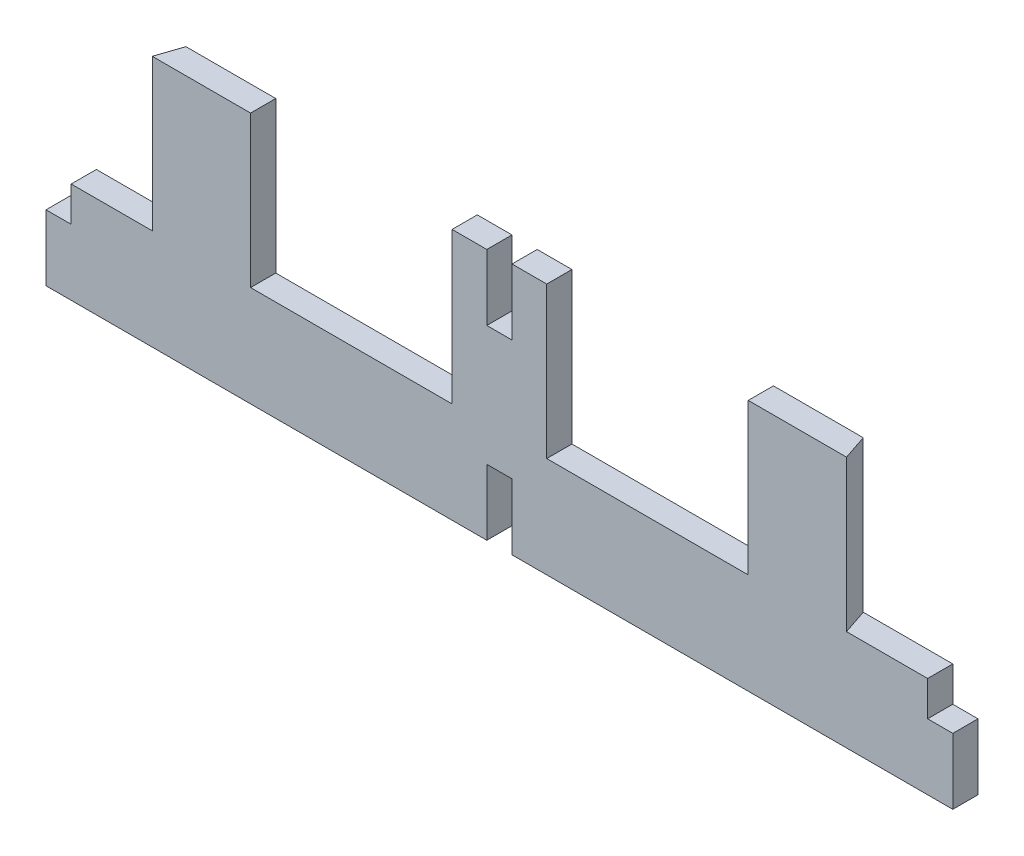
ISO-10303-21;
HEADER;
FILE_DESCRIPTION(('STEP AP214'),'2;1');
FILE_NAME('part.step','',(''),(''),'','','');
FILE_SCHEMA(('AUTOMOTIVE_DESIGN { 1 0 10303 214 1 1 1 1 }'));
ENDSEC;
DATA;
#1=APPLICATION_CONTEXT('core data for automotive mechanical design processes');
#2=APPLICATION_PROTOCOL_DEFINITION('international standard','automotive_design',2000,#1);
#3=PRODUCT_CONTEXT('',#1,'mechanical');
#4=PRODUCT('Part','Part','',(#3));
#5=PRODUCT_RELATED_PRODUCT_CATEGORY('part','',(#4));
#6=PRODUCT_DEFINITION_FORMATION('','',#4);
#7=PRODUCT_DEFINITION_CONTEXT('part definition',#1,'design');
#8=PRODUCT_DEFINITION('design','',#6,#7);
#9=PRODUCT_DEFINITION_SHAPE('','',#8);
#10=(LENGTH_UNIT() NAMED_UNIT(*) SI_UNIT(.MILLI.,.METRE.));
#11=(NAMED_UNIT(*) PLANE_ANGLE_UNIT() SI_UNIT($,.RADIAN.));
#12=(NAMED_UNIT(*) SI_UNIT($,.STERADIAN.) SOLID_ANGLE_UNIT());
#13=UNCERTAINTY_MEASURE_WITH_UNIT(LENGTH_MEASURE(1.E-05),#10,'distance_accuracy_value','');
#14=(GEOMETRIC_REPRESENTATION_CONTEXT(3) GLOBAL_UNCERTAINTY_ASSIGNED_CONTEXT((#13)) GLOBAL_UNIT_ASSIGNED_CONTEXT((#10,
#11,#12)) REPRESENTATION_CONTEXT('',''));
#15=CARTESIAN_POINT('',(0.,0.,0.));
#16=DIRECTION('',(0.,0.,1.));
#17=DIRECTION('',(1.,0.,0.));
#18=AXIS2_PLACEMENT_3D('',#15,#16,#17);
#19=CARTESIAN_POINT('',(-215.9,93.8094552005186,12.7));
#20=DIRECTION('',(1.,0.,0.));
#21=DIRECTION('',(0.,1.,0.));
#22=AXIS2_PLACEMENT_3D('',#19,#20,#21);
#23=PLANE('',#22);
#24=DIRECTION('',(0.,0.,1.));
#25=VECTOR('',#24,1.);
#26=CARTESIAN_POINT('',(-215.9,50.8,12.7));
#27=LINE('',#26,#25);
#28=CARTESIAN_POINT('',(-215.9,50.8,0.));
#29=VERTEX_POINT('',#28);
#30=CARTESIAN_POINT('',(-215.9,50.8,12.7));
#31=VERTEX_POINT('',#30);
#32=EDGE_CURVE('E249',#29,#31,#27,.T.);
#33=ORIENTED_EDGE('',*,*,#32,.F.);
#34=DIRECTION('',(0.,-1.,0.));
#35=VECTOR('',#34,1.);
#36=CARTESIAN_POINT('',(-215.9,93.8094552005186,0.));
#37=LINE('',#36,#35);
#38=CARTESIAN_POINT('',(-215.9,33.1905447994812,0.));
#39=VERTEX_POINT('',#38);
#40=EDGE_CURVE('E296',#29,#39,#37,.T.);
#41=ORIENTED_EDGE('',*,*,#40,.T.);
#42=DIRECTION('',(0.,0.,-1.));
#43=VECTOR('',#42,1.);
#44=CARTESIAN_POINT('',(-215.9,33.1905447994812,12.7));
#45=LINE('',#44,#43);
#46=CARTESIAN_POINT('',(-215.9,33.1905447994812,12.7));
#47=VERTEX_POINT('',#46);
#48=EDGE_CURVE('E38',#47,#39,#45,.T.);
#49=ORIENTED_EDGE('',*,*,#48,.F.);
#50=DIRECTION('',(0.,-1.,0.));
#51=VECTOR('',#50,1.);
#52=CARTESIAN_POINT('',(-215.9,93.8094552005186,12.7));
#53=LINE('',#52,#51);
#54=EDGE_CURVE('E305',#31,#47,#53,.T.);
#55=ORIENTED_EDGE('',*,*,#54,.F.);
#56=EDGE_LOOP('',(#33,#41,#49,#55));
#57=FACE_BOUND('',#56,.T.);
#58=ADVANCED_FACE('F31',(#57),#23,.F.);
#59=CARTESIAN_POINT('',(-228.6,127.,12.7));
#60=DIRECTION('',(0.,-1.,0.));
#61=DIRECTION('',(1.,0.,0.));
#62=AXIS2_PLACEMENT_3D('',#59,#60,#61);
#63=PLANE('',#62);
#64=DIRECTION('',(-1.,0.,0.));
#65=VECTOR('',#64,1.);
#66=CARTESIAN_POINT('',(-228.6,127.,0.));
#67=LINE('',#66,#65);
#68=CARTESIAN_POINT('',(-125.459231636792,127.,0.));
#69=VERTEX_POINT('',#68);
#70=CARTESIAN_POINT('',(-170.743201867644,127.,0.));
#71=VERTEX_POINT('',#70);
#72=EDGE_CURVE('E372',#69,#71,#67,.T.);
#73=ORIENTED_EDGE('',*,*,#72,.T.);
#74=DIRECTION('',(0.318463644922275,0.,-0.947935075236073));
#75=VECTOR('',#74,1.);
#76=CARTESIAN_POINT('',(-175.009831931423,127.,12.7));
#77=LINE('',#76,#75);
#78=CARTESIAN_POINT('',(-175.009831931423,127.,12.7));
#79=VERTEX_POINT('',#78);
#80=EDGE_CURVE('E238',#79,#71,#77,.T.);
#81=ORIENTED_EDGE('',*,*,#80,.F.);
#82=DIRECTION('',(-1.,0.,0.));
#83=VECTOR('',#82,1.);
#84=CARTESIAN_POINT('',(-228.6,127.,12.7));
#85=LINE('',#84,#83);
#86=CARTESIAN_POINT('',(-125.459231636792,127.,12.7));
#87=VERTEX_POINT('',#86);
#88=EDGE_CURVE('E336',#87,#79,#85,.T.);
#89=ORIENTED_EDGE('',*,*,#88,.F.);
#90=DIRECTION('',(0.,0.,1.));
#91=VECTOR('',#90,1.);
#92=CARTESIAN_POINT('',(-125.459231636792,127.,0.));
#93=LINE('',#92,#91);
#94=EDGE_CURVE('E252',#69,#87,#93,.T.);
#95=ORIENTED_EDGE('',*,*,#94,.F.);
#96=EDGE_LOOP('',(#73,#81,#89,#95));
#97=FACE_BOUND('',#96,.T.);
#98=ADVANCED_FACE('F450',(#97),#63,.F.);
#99=CARTESIAN_POINT('',(6.35,127.,12.7));
#100=DIRECTION('',(0.,-1.,0.));
#101=DIRECTION('',(1.,0.,0.));
#102=AXIS2_PLACEMENT_3D('',#99,#100,#101);
#103=PLANE('',#102);
#104=DIRECTION('',(-1.,0.,0.));
#105=VECTOR('',#104,1.);
#106=CARTESIAN_POINT('',(6.35,127.,12.7));
#107=LINE('',#106,#105);
#108=CARTESIAN_POINT('',(23.8592316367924,127.,12.7));
#109=VERTEX_POINT('',#108);
#110=CARTESIAN_POINT('',(6.35,127.,12.7));
#111=VERTEX_POINT('',#110);
#112=EDGE_CURVE('E327',#109,#111,#107,.T.);
#113=ORIENTED_EDGE('',*,*,#112,.F.);
#114=DIRECTION('',(0.,0.,1.));
#115=VECTOR('',#114,1.);
#116=CARTESIAN_POINT('',(23.8592316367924,127.,0.));
#117=LINE('',#116,#115);
#118=CARTESIAN_POINT('',(23.8592316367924,127.,0.));
#119=VERTEX_POINT('',#118);
#120=EDGE_CURVE('E270',#119,#109,#117,.T.);
#121=ORIENTED_EDGE('',*,*,#120,.F.);
#122=DIRECTION('',(-1.,0.,0.));
#123=VECTOR('',#122,1.);
#124=CARTESIAN_POINT('',(6.35,127.,0.));
#125=LINE('',#124,#123);
#126=CARTESIAN_POINT('',(6.35,127.,0.));
#127=VERTEX_POINT('',#126);
#128=EDGE_CURVE('E363',#119,#127,#125,.T.);
#129=ORIENTED_EDGE('',*,*,#128,.T.);
#130=DIRECTION('',(0.,0.,-1.));
#131=VECTOR('',#130,1.);
#132=CARTESIAN_POINT('',(6.35,127.,12.7));
#133=LINE('',#132,#131);
#134=EDGE_CURVE('E383',#111,#127,#133,.T.);
#135=ORIENTED_EDGE('',*,*,#134,.F.);
#136=EDGE_LOOP('',(#113,#121,#129,#135));
#137=FACE_BOUND('',#136,.T.);
#138=ADVANCED_FACE('F486',(#137),#103,.F.);
#139=CARTESIAN_POINT('',(-215.9,33.1905447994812,12.7));
#140=DIRECTION('',(0.,-1.,0.));
#141=DIRECTION('',(0.,0.,-1.));
#142=AXIS2_PLACEMENT_3D('',#139,#140,#141);
#143=PLANE('',#142);
#144=DIRECTION('',(-1.,0.,0.));
#145=VECTOR('',#144,1.);
#146=CARTESIAN_POINT('',(-215.9,33.1905447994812,0.));
#147=LINE('',#146,#145);
#148=CARTESIAN_POINT('',(-228.6,33.1905447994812,0.));
#149=VERTEX_POINT('',#148);
#150=EDGE_CURVE('E342',#39,#149,#147,.T.);
#151=ORIENTED_EDGE('',*,*,#150,.T.);
#152=DIRECTION('',(0.,0.,-1.));
#153=VECTOR('',#152,1.);
#154=CARTESIAN_POINT('',(-228.6,33.1905447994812,12.7));
#155=LINE('',#154,#153);
#156=CARTESIAN_POINT('',(-228.6,33.1905447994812,12.7));
#157=VERTEX_POINT('',#156);
#158=EDGE_CURVE('E410',#157,#149,#155,.T.);
#159=ORIENTED_EDGE('',*,*,#158,.F.);
#160=DIRECTION('',(-1.,0.,0.));
#161=VECTOR('',#160,1.);
#162=CARTESIAN_POINT('',(-215.9,33.1905447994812,12.7));
#163=LINE('',#162,#161);
#164=EDGE_CURVE('E307',#47,#157,#163,.T.);
#165=ORIENTED_EDGE('',*,*,#164,.F.);
#166=ORIENTED_EDGE('',*,*,#48,.T.);
#167=EDGE_LOOP('',(#151,#159,#165,#166));
#168=FACE_BOUND('',#167,.T.);
#169=ADVANCED_FACE('F417',(#168),#143,.F.);
#170=CARTESIAN_POINT('',(-228.6,0.,12.7));
#171=DIRECTION('',(1.,0.,0.));
#172=DIRECTION('',(0.,0.,-1.));
#173=AXIS2_PLACEMENT_3D('',#170,#171,#172);
#174=PLANE('',#173);
#175=DIRECTION('',(0.,-1.,0.));
#176=VECTOR('',#175,1.);
#177=CARTESIAN_POINT('',(-228.6,0.,0.));
#178=LINE('',#177,#176);
#179=CARTESIAN_POINT('',(-228.6,0.,0.));
#180=VERTEX_POINT('',#179);
#181=EDGE_CURVE('E344',#149,#180,#178,.T.);
#182=ORIENTED_EDGE('',*,*,#181,.T.);
#183=DIRECTION('',(0.,0.,-1.));
#184=VECTOR('',#183,1.);
#185=CARTESIAN_POINT('',(-228.6,0.,12.7));
#186=LINE('',#185,#184);
#187=CARTESIAN_POINT('',(-228.6,0.,12.7));
#188=VERTEX_POINT('',#187);
#189=EDGE_CURVE('E407',#188,#180,#186,.T.);
#190=ORIENTED_EDGE('',*,*,#189,.F.);
#191=DIRECTION('',(0.,-1.,0.));
#192=VECTOR('',#191,1.);
#193=CARTESIAN_POINT('',(-228.6,0.,12.7));
#194=LINE('',#193,#192);
#195=EDGE_CURVE('E310',#157,#188,#194,.T.);
#196=ORIENTED_EDGE('',*,*,#195,.F.);
#197=ORIENTED_EDGE('',*,*,#158,.T.);
#198=EDGE_LOOP('',(#182,#190,#196,#197));
#199=FACE_BOUND('',#198,.T.);
#200=ADVANCED_FACE('F431',(#199),#174,.F.);
#201=CARTESIAN_POINT('',(-6.35,0.,12.7));
#202=DIRECTION('',(0.,1.,0.));
#203=DIRECTION('',(0.,0.,1.));
#204=AXIS2_PLACEMENT_3D('',#201,#202,#203);
#205=PLANE('',#204);
#206=DIRECTION('',(1.,0.,0.));
#207=VECTOR('',#206,1.);
#208=CARTESIAN_POINT('',(-6.35,0.,0.));
#209=LINE('',#208,#207);
#210=CARTESIAN_POINT('',(-6.35,0.,0.));
#211=VERTEX_POINT('',#210);
#212=EDGE_CURVE('E346',#180,#211,#209,.T.);
#213=ORIENTED_EDGE('',*,*,#212,.T.);
#214=DIRECTION('',(0.,0.,-1.));
#215=VECTOR('',#214,1.);
#216=CARTESIAN_POINT('',(-6.35,0.,12.7));
#217=LINE('',#216,#215);
#218=CARTESIAN_POINT('',(-6.35,0.,12.7));
#219=VERTEX_POINT('',#218);
#220=EDGE_CURVE('E404',#219,#211,#217,.T.);
#221=ORIENTED_EDGE('',*,*,#220,.F.);
#222=DIRECTION('',(1.,0.,0.));
#223=VECTOR('',#222,1.);
#224=CARTESIAN_POINT('',(-6.35,0.,12.7));
#225=LINE('',#224,#223);
#226=EDGE_CURVE('E312',#188,#219,#225,.T.);
#227=ORIENTED_EDGE('',*,*,#226,.F.);
#228=ORIENTED_EDGE('',*,*,#189,.T.);
#229=EDGE_LOOP('',(#213,#221,#227,#228));
#230=FACE_BOUND('',#229,.T.);
#231=ADVANCED_FACE('F435',(#230),#205,.F.);
#232=CARTESIAN_POINT('',(-6.35,33.1905447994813,12.7));
#233=DIRECTION('',(-1.,0.,0.));
#234=DIRECTION('',(0.,0.,1.));
#235=AXIS2_PLACEMENT_3D('',#232,#233,#234);
#236=PLANE('',#235);
#237=DIRECTION('',(0.,1.,0.));
#238=VECTOR('',#237,1.);
#239=CARTESIAN_POINT('',(-6.35,33.1905447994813,0.));
#240=LINE('',#239,#238);
#241=CARTESIAN_POINT('',(-6.35,33.1905447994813,0.));
#242=VERTEX_POINT('',#241);
#243=EDGE_CURVE('E348',#211,#242,#240,.T.);
#244=ORIENTED_EDGE('',*,*,#243,.T.);
#245=DIRECTION('',(0.,0.,-1.));
#246=VECTOR('',#245,1.);
#247=CARTESIAN_POINT('',(-6.35,33.1905447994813,12.7));
#248=LINE('',#247,#246);
#249=CARTESIAN_POINT('',(-6.35,33.1905447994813,12.7));
#250=VERTEX_POINT('',#249);
#251=EDGE_CURVE('E401',#250,#242,#248,.T.);
#252=ORIENTED_EDGE('',*,*,#251,.F.);
#253=DIRECTION('',(0.,1.,0.));
#254=VECTOR('',#253,1.);
#255=CARTESIAN_POINT('',(-6.35,33.1905447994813,12.7));
#256=LINE('',#255,#254);
#257=EDGE_CURVE('E314',#219,#250,#256,.T.);
#258=ORIENTED_EDGE('',*,*,#257,.F.);
#259=ORIENTED_EDGE('',*,*,#220,.T.);
#260=EDGE_LOOP('',(#244,#252,#258,#259));
#261=FACE_BOUND('',#260,.T.);
#262=ADVANCED_FACE('F590',(#261),#236,.F.);
#263=CARTESIAN_POINT('',(6.35,33.1905447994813,12.7));
#264=DIRECTION('',(0.,1.,0.));
#265=DIRECTION('',(0.,0.,1.));
#266=AXIS2_PLACEMENT_3D('',#263,#264,#265);
#267=PLANE('',#266);
#268=DIRECTION('',(1.,0.,0.));
#269=VECTOR('',#268,1.);
#270=CARTESIAN_POINT('',(6.35,33.1905447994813,0.));
#271=LINE('',#270,#269);
#272=CARTESIAN_POINT('',(6.35,33.1905447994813,0.));
#273=VERTEX_POINT('',#272);
#274=EDGE_CURVE('E350',#242,#273,#271,.T.);
#275=ORIENTED_EDGE('',*,*,#274,.T.);
#276=DIRECTION('',(0.,0.,-1.));
#277=VECTOR('',#276,1.);
#278=CARTESIAN_POINT('',(6.35,33.1905447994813,12.7));
#279=LINE('',#278,#277);
#280=CARTESIAN_POINT('',(6.35,33.1905447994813,12.7));
#281=VERTEX_POINT('',#280);
#282=EDGE_CURVE('E398',#281,#273,#279,.T.);
#283=ORIENTED_EDGE('',*,*,#282,.F.);
#284=DIRECTION('',(1.,0.,0.));
#285=VECTOR('',#284,1.);
#286=CARTESIAN_POINT('',(6.35,33.1905447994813,12.7));
#287=LINE('',#286,#285);
#288=EDGE_CURVE('E316',#250,#281,#287,.T.);
#289=ORIENTED_EDGE('',*,*,#288,.F.);
#290=ORIENTED_EDGE('',*,*,#251,.T.);
#291=EDGE_LOOP('',(#275,#283,#289,#290));
#292=FACE_BOUND('',#291,.T.);
#293=ADVANCED_FACE('F580',(#292),#267,.F.);
#294=CARTESIAN_POINT('',(6.35,33.1905447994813,12.7));
#295=DIRECTION('',(1.,0.,0.));
#296=DIRECTION('',(0.,0.,-1.));
#297=AXIS2_PLACEMENT_3D('',#294,#295,#296);
#298=PLANE('',#297);
#299=DIRECTION('',(0.,-1.,0.));
#300=VECTOR('',#299,1.);
#301=CARTESIAN_POINT('',(6.35,33.1905447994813,0.));
#302=LINE('',#301,#300);
#303=CARTESIAN_POINT('',(6.35,0.,0.));
#304=VERTEX_POINT('',#303);
#305=EDGE_CURVE('E352',#273,#304,#302,.T.);
#306=ORIENTED_EDGE('',*,*,#305,.T.);
#307=DIRECTION('',(0.,0.,-1.));
#308=VECTOR('',#307,1.);
#309=CARTESIAN_POINT('',(6.35,0.,12.7));
#310=LINE('',#309,#308);
#311=CARTESIAN_POINT('',(6.35,0.,12.7));
#312=VERTEX_POINT('',#311);
#313=EDGE_CURVE('E395',#312,#304,#310,.T.);
#314=ORIENTED_EDGE('',*,*,#313,.F.);
#315=DIRECTION('',(0.,-1.,0.));
#316=VECTOR('',#315,1.);
#317=CARTESIAN_POINT('',(6.35,33.1905447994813,12.7));
#318=LINE('',#317,#316);
#319=EDGE_CURVE('E318',#281,#312,#318,.T.);
#320=ORIENTED_EDGE('',*,*,#319,.F.);
#321=ORIENTED_EDGE('',*,*,#282,.T.);
#322=EDGE_LOOP('',(#306,#314,#320,#321));
#323=FACE_BOUND('',#322,.T.);
#324=ADVANCED_FACE('F570',(#323),#298,.F.);
#325=CARTESIAN_POINT('',(6.35,0.,12.7));
#326=DIRECTION('',(0.,1.,0.));
#327=DIRECTION('',(0.,0.,1.));
#328=AXIS2_PLACEMENT_3D('',#325,#326,#327);
#329=PLANE('',#328);
#330=DIRECTION('',(1.,0.,0.));
#331=VECTOR('',#330,1.);
#332=CARTESIAN_POINT('',(6.35,0.,0.));
#333=LINE('',#332,#331);
#334=CARTESIAN_POINT('',(228.6,0.,0.));
#335=VERTEX_POINT('',#334);
#336=EDGE_CURVE('E354',#304,#335,#333,.T.);
#337=ORIENTED_EDGE('',*,*,#336,.T.);
#338=DIRECTION('',(0.,0.,-1.));
#339=VECTOR('',#338,1.);
#340=CARTESIAN_POINT('',(228.6,0.,12.7));
#341=LINE('',#340,#339);
#342=CARTESIAN_POINT('',(228.6,0.,12.7));
#343=VERTEX_POINT('',#342);
#344=EDGE_CURVE('E392',#343,#335,#341,.T.);
#345=ORIENTED_EDGE('',*,*,#344,.F.);
#346=DIRECTION('',(1.,0.,0.));
#347=VECTOR('',#346,1.);
#348=CARTESIAN_POINT('',(6.35,0.,12.7));
#349=LINE('',#348,#347);
#350=EDGE_CURVE('E320',#312,#343,#349,.T.);
#351=ORIENTED_EDGE('',*,*,#350,.F.);
#352=ORIENTED_EDGE('',*,*,#313,.T.);
#353=EDGE_LOOP('',(#337,#345,#351,#352));
#354=FACE_BOUND('',#353,.T.);
#355=ADVANCED_FACE('F560',(#354),#329,.F.);
#356=CARTESIAN_POINT('',(228.6,0.,12.7));
#357=DIRECTION('',(-1.,0.,0.));
#358=DIRECTION('',(0.,0.,1.));
#359=AXIS2_PLACEMENT_3D('',#356,#357,#358);
#360=PLANE('',#359);
#361=DIRECTION('',(0.,1.,0.));
#362=VECTOR('',#361,1.);
#363=CARTESIAN_POINT('',(228.6,0.,0.));
#364=LINE('',#363,#362);
#365=CARTESIAN_POINT('',(228.6,33.1905447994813,0.));
#366=VERTEX_POINT('',#365);
#367=EDGE_CURVE('E356',#335,#366,#364,.T.);
#368=ORIENTED_EDGE('',*,*,#367,.T.);
#369=DIRECTION('',(0.,0.,-1.));
#370=VECTOR('',#369,1.);
#371=CARTESIAN_POINT('',(228.6,33.1905447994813,12.7));
#372=LINE('',#371,#370);
#373=CARTESIAN_POINT('',(228.6,33.1905447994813,12.7));
#374=VERTEX_POINT('',#373);
#375=EDGE_CURVE('E389',#374,#366,#372,.T.);
#376=ORIENTED_EDGE('',*,*,#375,.F.);
#377=DIRECTION('',(0.,1.,0.));
#378=VECTOR('',#377,1.);
#379=CARTESIAN_POINT('',(228.6,0.,12.7));
#380=LINE('',#379,#378);
#381=EDGE_CURVE('E322',#343,#374,#380,.T.);
#382=ORIENTED_EDGE('',*,*,#381,.F.);
#383=ORIENTED_EDGE('',*,*,#344,.T.);
#384=EDGE_LOOP('',(#368,#376,#382,#383));
#385=FACE_BOUND('',#384,.T.);
#386=ADVANCED_FACE('F549',(#385),#360,.F.);
#387=CARTESIAN_POINT('',(215.9,33.1905447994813,12.7));
#388=DIRECTION('',(0.,-1.,0.));
#389=DIRECTION('',(0.,0.,-1.));
#390=AXIS2_PLACEMENT_3D('',#387,#388,#389);
#391=PLANE('',#390);
#392=DIRECTION('',(-1.,0.,0.));
#393=VECTOR('',#392,1.);
#394=CARTESIAN_POINT('',(215.9,33.1905447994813,0.));
#395=LINE('',#394,#393);
#396=CARTESIAN_POINT('',(215.9,33.1905447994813,0.));
#397=VERTEX_POINT('',#396);
#398=EDGE_CURVE('E358',#366,#397,#395,.T.);
#399=ORIENTED_EDGE('',*,*,#398,.T.);
#400=DIRECTION('',(0.,0.,-1.));
#401=VECTOR('',#400,1.);
#402=CARTESIAN_POINT('',(215.9,33.1905447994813,12.7));
#403=LINE('',#402,#401);
#404=CARTESIAN_POINT('',(215.9,33.1905447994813,12.7));
#405=VERTEX_POINT('',#404);
#406=EDGE_CURVE('E386',#405,#397,#403,.T.);
#407=ORIENTED_EDGE('',*,*,#406,.F.);
#408=DIRECTION('',(-1.,0.,0.));
#409=VECTOR('',#408,1.);
#410=CARTESIAN_POINT('',(215.9,33.1905447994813,12.7));
#411=LINE('',#410,#409);
#412=EDGE_CURVE('E324',#374,#405,#411,.T.);
#413=ORIENTED_EDGE('',*,*,#412,.F.);
#414=ORIENTED_EDGE('',*,*,#375,.T.);
#415=EDGE_LOOP('',(#399,#407,#413,#414));
#416=FACE_BOUND('',#415,.T.);
#417=ADVANCED_FACE('F510',(#416),#391,.F.);
#418=CARTESIAN_POINT('',(215.9,93.8094552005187,12.7));
#419=DIRECTION('',(-1.,0.,0.));
#420=DIRECTION('',(0.,0.,1.));
#421=AXIS2_PLACEMENT_3D('',#418,#419,#420);
#422=PLANE('',#421);
#423=DIRECTION('',(0.,1.,0.));
#424=VECTOR('',#423,1.);
#425=CARTESIAN_POINT('',(215.9,93.8094552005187,0.));
#426=LINE('',#425,#424);
#427=CARTESIAN_POINT('',(215.9,50.7999999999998,0.));
#428=VERTEX_POINT('',#427);
#429=EDGE_CURVE('E360',#397,#428,#426,.T.);
#430=ORIENTED_EDGE('',*,*,#429,.T.);
#431=DIRECTION('',(0.,0.,1.));
#432=VECTOR('',#431,1.);
#433=CARTESIAN_POINT('',(215.9,50.7999999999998,12.7));
#434=LINE('',#433,#432);
#435=CARTESIAN_POINT('',(215.9,50.7999999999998,12.7));
#436=VERTEX_POINT('',#435);
#437=EDGE_CURVE('E45',#428,#436,#434,.T.);
#438=ORIENTED_EDGE('',*,*,#437,.T.);
#439=DIRECTION('',(0.,1.,0.));
#440=VECTOR('',#439,1.);
#441=CARTESIAN_POINT('',(215.9,93.8094552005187,12.7));
#442=LINE('',#441,#440);
#443=EDGE_CURVE('E232',#405,#436,#442,.T.);
#444=ORIENTED_EDGE('',*,*,#443,.F.);
#445=ORIENTED_EDGE('',*,*,#406,.T.);
#446=EDGE_LOOP('',(#430,#438,#444,#445));
#447=FACE_BOUND('',#446,.T.);
#448=ADVANCED_FACE('F503',(#447),#422,.F.);
#449=CARTESIAN_POINT('',(175.009831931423,127.,12.7));
#450=VERTEX_POINT('',#449);
#451=CARTESIAN_POINT('',(125.459231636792,127.,12.7));
#452=VERTEX_POINT('',#451);
#453=EDGE_CURVE('E328',#450,#452,#107,.T.);
#454=ORIENTED_EDGE('',*,*,#453,.F.);
#455=DIRECTION('',(0.318463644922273,0.,0.947935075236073));
#456=VECTOR('',#455,1.);
#457=CARTESIAN_POINT('',(170.743201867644,127.,0.));
#458=LINE('',#457,#456);
#459=CARTESIAN_POINT('',(170.743201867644,127.,0.));
#460=VERTEX_POINT('',#459);
#461=EDGE_CURVE('E220',#460,#450,#458,.T.);
#462=ORIENTED_EDGE('',*,*,#461,.F.);
#463=CARTESIAN_POINT('',(125.459231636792,127.,0.));
#464=VERTEX_POINT('',#463);
#465=EDGE_CURVE('E364',#460,#464,#125,.T.);
#466=ORIENTED_EDGE('',*,*,#465,.T.);
#467=DIRECTION('',(0.,0.,-1.));
#468=VECTOR('',#467,1.);
#469=CARTESIAN_POINT('',(125.459231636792,127.,0.));
#470=LINE('',#469,#468);
#471=EDGE_CURVE('E282',#452,#464,#470,.T.);
#472=ORIENTED_EDGE('',*,*,#471,.F.);
#473=EDGE_LOOP('',(#454,#462,#466,#472));
#474=FACE_BOUND('',#473,.T.);
#475=ADVANCED_FACE('F501',(#474),#103,.F.);
#476=CARTESIAN_POINT('',(6.35,127.,12.7));
#477=DIRECTION('',(1.,0.,0.));
#478=DIRECTION('',(0.,0.,-1.));
#479=AXIS2_PLACEMENT_3D('',#476,#477,#478);
#480=PLANE('',#479);
#481=DIRECTION('',(0.,-1.,0.));
#482=VECTOR('',#481,1.);
#483=CARTESIAN_POINT('',(6.35,127.,0.));
#484=LINE('',#483,#482);
#485=CARTESIAN_POINT('',(6.35,93.8094552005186,0.));
#486=VERTEX_POINT('',#485);
#487=EDGE_CURVE('E366',#127,#486,#484,.T.);
#488=ORIENTED_EDGE('',*,*,#487,.T.);
#489=DIRECTION('',(0.,0.,-1.));
#490=VECTOR('',#489,1.);
#491=CARTESIAN_POINT('',(6.35,93.8094552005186,12.7));
#492=LINE('',#491,#490);
#493=CARTESIAN_POINT('',(6.35,93.8094552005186,12.7));
#494=VERTEX_POINT('',#493);
#495=EDGE_CURVE('E380',#494,#486,#492,.T.);
#496=ORIENTED_EDGE('',*,*,#495,.F.);
#497=DIRECTION('',(0.,-1.,0.));
#498=VECTOR('',#497,1.);
#499=CARTESIAN_POINT('',(6.35,127.,12.7));
#500=LINE('',#499,#498);
#501=EDGE_CURVE('E330',#111,#494,#500,.T.);
#502=ORIENTED_EDGE('',*,*,#501,.F.);
#503=ORIENTED_EDGE('',*,*,#134,.T.);
#504=EDGE_LOOP('',(#488,#496,#502,#503));
#505=FACE_BOUND('',#504,.T.);
#506=ADVANCED_FACE('F482',(#505),#480,.F.);
#507=CARTESIAN_POINT('',(6.35,93.8094552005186,12.7));
#508=DIRECTION('',(0.,-1.,0.));
#509=DIRECTION('',(0.,0.,-1.));
#510=AXIS2_PLACEMENT_3D('',#507,#508,#509);
#511=PLANE('',#510);
#512=DIRECTION('',(-1.,0.,0.));
#513=VECTOR('',#512,1.);
#514=CARTESIAN_POINT('',(6.35,93.8094552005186,0.));
#515=LINE('',#514,#513);
#516=CARTESIAN_POINT('',(-6.35,93.8094552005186,0.));
#517=VERTEX_POINT('',#516);
#518=EDGE_CURVE('E368',#486,#517,#515,.T.);
#519=ORIENTED_EDGE('',*,*,#518,.T.);
#520=DIRECTION('',(0.,0.,-1.));
#521=VECTOR('',#520,1.);
#522=CARTESIAN_POINT('',(-6.35,93.8094552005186,12.7));
#523=LINE('',#522,#521);
#524=CARTESIAN_POINT('',(-6.35,93.8094552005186,12.7));
#525=VERTEX_POINT('',#524);
#526=EDGE_CURVE('E377',#525,#517,#523,.T.);
#527=ORIENTED_EDGE('',*,*,#526,.F.);
#528=DIRECTION('',(-1.,0.,0.));
#529=VECTOR('',#528,1.);
#530=CARTESIAN_POINT('',(6.35,93.8094552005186,12.7));
#531=LINE('',#530,#529);
#532=EDGE_CURVE('E332',#494,#525,#531,.T.);
#533=ORIENTED_EDGE('',*,*,#532,.F.);
#534=ORIENTED_EDGE('',*,*,#495,.T.);
#535=EDGE_LOOP('',(#519,#527,#533,#534));
#536=FACE_BOUND('',#535,.T.);
#537=ADVANCED_FACE('F477',(#536),#511,.F.);
#538=CARTESIAN_POINT('',(-6.35,127.,12.7));
#539=DIRECTION('',(-1.,0.,0.));
#540=DIRECTION('',(0.,0.,1.));
#541=AXIS2_PLACEMENT_3D('',#538,#539,#540);
#542=PLANE('',#541);
#543=DIRECTION('',(0.,1.,0.));
#544=VECTOR('',#543,1.);
#545=CARTESIAN_POINT('',(-6.35,127.,0.));
#546=LINE('',#545,#544);
#547=CARTESIAN_POINT('',(-6.35,127.,0.));
#548=VERTEX_POINT('',#547);
#549=EDGE_CURVE('E370',#517,#548,#546,.T.);
#550=ORIENTED_EDGE('',*,*,#549,.T.);
#551=DIRECTION('',(0.,0.,-1.));
#552=VECTOR('',#551,1.);
#553=CARTESIAN_POINT('',(-6.35,127.,12.7));
#554=LINE('',#553,#552);
#555=CARTESIAN_POINT('',(-6.35,127.,12.7));
#556=VERTEX_POINT('',#555);
#557=EDGE_CURVE('E340',#556,#548,#554,.T.);
#558=ORIENTED_EDGE('',*,*,#557,.F.);
#559=DIRECTION('',(0.,1.,0.));
#560=VECTOR('',#559,1.);
#561=CARTESIAN_POINT('',(-6.35,127.,12.7));
#562=LINE('',#561,#560);
#563=EDGE_CURVE('E334',#525,#556,#562,.T.);
#564=ORIENTED_EDGE('',*,*,#563,.F.);
#565=ORIENTED_EDGE('',*,*,#526,.T.);
#566=EDGE_LOOP('',(#550,#558,#564,#565));
#567=FACE_BOUND('',#566,.T.);
#568=ADVANCED_FACE('F471',(#567),#542,.F.);
#569=CARTESIAN_POINT('',(-23.8592316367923,127.,0.));
#570=VERTEX_POINT('',#569);
#571=EDGE_CURVE('E308',#548,#570,#67,.T.);
#572=ORIENTED_EDGE('',*,*,#571,.T.);
#573=DIRECTION('',(0.,0.,-1.));
#574=VECTOR('',#573,1.);
#575=CARTESIAN_POINT('',(-23.8592316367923,127.,0.));
#576=LINE('',#575,#574);
#577=CARTESIAN_POINT('',(-23.8592316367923,127.,12.7));
#578=VERTEX_POINT('',#577);
#579=EDGE_CURVE('E257',#578,#570,#576,.T.);
#580=ORIENTED_EDGE('',*,*,#579,.F.);
#581=EDGE_CURVE('E337',#556,#578,#85,.T.);
#582=ORIENTED_EDGE('',*,*,#581,.F.);
#583=ORIENTED_EDGE('',*,*,#557,.T.);
#584=EDGE_LOOP('',(#572,#580,#582,#583));
#585=FACE_BOUND('',#584,.T.);
#586=ADVANCED_FACE('F466',(#585),#63,.F.);
#587=CARTESIAN_POINT('',(-228.6,93.8094552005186,12.7));
#588=DIRECTION('',(0.,0.,1.));
#589=DIRECTION('',(1.,0.,0.));
#590=AXIS2_PLACEMENT_3D('',#587,#588,#589);
#591=PLANE('',#590);
#592=DIRECTION('',(0.,1.,0.));
#593=VECTOR('',#592,1.);
#594=CARTESIAN_POINT('',(175.009831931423,50.7999999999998,12.7));
#595=LINE('',#594,#593);
#596=CARTESIAN_POINT('',(175.009831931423,50.7999999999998,12.7));
#597=VERTEX_POINT('',#596);
#598=EDGE_CURVE('E214',#597,#450,#595,.T.);
#599=ORIENTED_EDGE('',*,*,#598,.T.);
#600=ORIENTED_EDGE('',*,*,#453,.T.);
#601=DIRECTION('',(0.,1.,0.));
#602=VECTOR('',#601,1.);
#603=CARTESIAN_POINT('',(125.459231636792,50.7999999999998,12.7));
#604=LINE('',#603,#602);
#605=CARTESIAN_POINT('',(125.459231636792,50.7999999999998,12.7));
#606=VERTEX_POINT('',#605);
#607=EDGE_CURVE('E300',#606,#452,#604,.T.);
#608=ORIENTED_EDGE('',*,*,#607,.F.);
#609=DIRECTION('',(1.,0.,0.));
#610=VECTOR('',#609,1.);
#611=CARTESIAN_POINT('',(23.8592316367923,50.7999999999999,12.7));
#612=LINE('',#611,#610);
#613=CARTESIAN_POINT('',(23.8592316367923,50.7999999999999,12.7));
#614=VERTEX_POINT('',#613);
#615=EDGE_CURVE('E281',#614,#606,#612,.T.);
#616=ORIENTED_EDGE('',*,*,#615,.F.);
#617=DIRECTION('',(0.,1.,0.));
#618=VECTOR('',#617,1.);
#619=CARTESIAN_POINT('',(23.8592316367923,50.7999999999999,12.7));
#620=LINE('',#619,#618);
#621=EDGE_CURVE('E290',#614,#109,#620,.T.);
#622=ORIENTED_EDGE('',*,*,#621,.T.);
#623=ORIENTED_EDGE('',*,*,#112,.T.);
#624=ORIENTED_EDGE('',*,*,#501,.T.);
#625=ORIENTED_EDGE('',*,*,#532,.T.);
#626=ORIENTED_EDGE('',*,*,#563,.T.);
#627=ORIENTED_EDGE('',*,*,#581,.T.);
#628=DIRECTION('',(0.,1.,0.));
#629=VECTOR('',#628,1.);
#630=CARTESIAN_POINT('',(-23.8592316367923,50.7999999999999,12.7));
#631=LINE('',#630,#629);
#632=CARTESIAN_POINT('',(-23.8592316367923,50.7999999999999,12.7));
#633=VERTEX_POINT('',#632);
#634=EDGE_CURVE('E274',#633,#578,#631,.T.);
#635=ORIENTED_EDGE('',*,*,#634,.F.);
#636=DIRECTION('',(1.,0.,0.));
#637=VECTOR('',#636,1.);
#638=CARTESIAN_POINT('',(-125.459231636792,50.8,12.7));
#639=LINE('',#638,#637);
#640=CARTESIAN_POINT('',(-125.459231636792,50.8,12.7));
#641=VERTEX_POINT('',#640);
#642=EDGE_CURVE('E256',#641,#633,#639,.T.);
#643=ORIENTED_EDGE('',*,*,#642,.F.);
#644=DIRECTION('',(0.,1.,0.));
#645=VECTOR('',#644,1.);
#646=CARTESIAN_POINT('',(-125.459231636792,50.8,12.7));
#647=LINE('',#646,#645);
#648=EDGE_CURVE('E265',#641,#87,#647,.T.);
#649=ORIENTED_EDGE('',*,*,#648,.T.);
#650=ORIENTED_EDGE('',*,*,#88,.T.);
#651=DIRECTION('',(0.,1.,0.));
#652=VECTOR('',#651,1.);
#653=CARTESIAN_POINT('',(-175.009831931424,50.8,12.7));
#654=LINE('',#653,#652);
#655=CARTESIAN_POINT('',(-175.009831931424,50.8,12.7));
#656=VERTEX_POINT('',#655);
#657=EDGE_CURVE('E244',#656,#79,#654,.T.);
#658=ORIENTED_EDGE('',*,*,#657,.F.);
#659=DIRECTION('',(1.,0.,0.));
#660=VECTOR('',#659,1.);
#661=CARTESIAN_POINT('',(-228.6,50.8,12.7));
#662=LINE('',#661,#660);
#663=EDGE_CURVE('E241',#31,#656,#662,.T.);
#664=ORIENTED_EDGE('',*,*,#663,.F.);
#665=ORIENTED_EDGE('',*,*,#54,.T.);
#666=ORIENTED_EDGE('',*,*,#164,.T.);
#667=ORIENTED_EDGE('',*,*,#195,.T.);
#668=ORIENTED_EDGE('',*,*,#226,.T.);
#669=ORIENTED_EDGE('',*,*,#257,.T.);
#670=ORIENTED_EDGE('',*,*,#288,.T.);
#671=ORIENTED_EDGE('',*,*,#319,.T.);
#672=ORIENTED_EDGE('',*,*,#350,.T.);
#673=ORIENTED_EDGE('',*,*,#381,.T.);
#674=ORIENTED_EDGE('',*,*,#412,.T.);
#675=ORIENTED_EDGE('',*,*,#443,.T.);
#676=DIRECTION('',(1.,0.,0.));
#677=VECTOR('',#676,1.);
#678=CARTESIAN_POINT('',(175.009831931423,50.7999999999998,12.7));
#679=LINE('',#678,#677);
#680=EDGE_CURVE('E225',#597,#436,#679,.T.);
#681=ORIENTED_EDGE('',*,*,#680,.F.);
#682=EDGE_LOOP('',(#599,#600,#608,#616,#622,#623,#624,#625,#626,#627,#635,#643,#649,#650,#658,
#664,#665,#666,#667,#668,#669,#670,#671,#672,#673,#674,#675,#681));
#683=FACE_BOUND('',#682,.T.);
#684=ADVANCED_FACE('F230',(#683),#591,.T.);
#685=CARTESIAN_POINT('',(-228.6,93.8094552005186,0.));
#686=DIRECTION('',(0.,0.,1.));
#687=DIRECTION('',(1.,0.,0.));
#688=AXIS2_PLACEMENT_3D('',#685,#686,#687);
#689=PLANE('',#688);
#690=ORIENTED_EDGE('',*,*,#465,.F.);
#691=DIRECTION('',(0.,1.,0.));
#692=VECTOR('',#691,1.);
#693=CARTESIAN_POINT('',(170.743201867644,50.7999999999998,0.));
#694=LINE('',#693,#692);
#695=CARTESIAN_POINT('',(170.743201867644,50.7999999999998,0.));
#696=VERTEX_POINT('',#695);
#697=EDGE_CURVE('E224',#696,#460,#694,.T.);
#698=ORIENTED_EDGE('',*,*,#697,.F.);
#699=DIRECTION('',(1.,0.,0.));
#700=VECTOR('',#699,1.);
#701=CARTESIAN_POINT('',(-228.6,50.8,0.));
#702=LINE('',#701,#700);
#703=EDGE_CURVE('E11',#696,#428,#702,.T.);
#704=ORIENTED_EDGE('',*,*,#703,.T.);
#705=ORIENTED_EDGE('',*,*,#429,.F.);
#706=ORIENTED_EDGE('',*,*,#398,.F.);
#707=ORIENTED_EDGE('',*,*,#367,.F.);
#708=ORIENTED_EDGE('',*,*,#336,.F.);
#709=ORIENTED_EDGE('',*,*,#305,.F.);
#710=ORIENTED_EDGE('',*,*,#274,.F.);
#711=ORIENTED_EDGE('',*,*,#243,.F.);
#712=ORIENTED_EDGE('',*,*,#212,.F.);
#713=ORIENTED_EDGE('',*,*,#181,.F.);
#714=ORIENTED_EDGE('',*,*,#150,.F.);
#715=ORIENTED_EDGE('',*,*,#40,.F.);
#716=DIRECTION('',(-1.,0.,0.));
#717=VECTOR('',#716,1.);
#718=CARTESIAN_POINT('',(-170.743201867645,50.8,0.));
#719=LINE('',#718,#717);
#720=CARTESIAN_POINT('',(-170.743201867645,50.8,0.));
#721=VERTEX_POINT('',#720);
#722=EDGE_CURVE('E239',#721,#29,#719,.T.);
#723=ORIENTED_EDGE('',*,*,#722,.F.);
#724=DIRECTION('',(0.,1.,0.));
#725=VECTOR('',#724,1.);
#726=CARTESIAN_POINT('',(-170.743201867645,50.8,0.));
#727=LINE('',#726,#725);
#728=EDGE_CURVE('E246',#721,#71,#727,.T.);
#729=ORIENTED_EDGE('',*,*,#728,.T.);
#730=ORIENTED_EDGE('',*,*,#72,.F.);
#731=DIRECTION('',(0.,1.,0.));
#732=VECTOR('',#731,1.);
#733=CARTESIAN_POINT('',(-125.459231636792,50.8,0.));
#734=LINE('',#733,#732);
#735=CARTESIAN_POINT('',(-125.459231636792,50.8,0.));
#736=VERTEX_POINT('',#735);
#737=EDGE_CURVE('E268',#736,#69,#734,.T.);
#738=ORIENTED_EDGE('',*,*,#737,.F.);
#739=DIRECTION('',(-1.,0.,0.));
#740=VECTOR('',#739,1.);
#741=CARTESIAN_POINT('',(-125.459231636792,50.8,0.));
#742=LINE('',#741,#740);
#743=CARTESIAN_POINT('',(-23.8592316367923,50.7999999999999,0.));
#744=VERTEX_POINT('',#743);
#745=EDGE_CURVE('E262',#744,#736,#742,.T.);
#746=ORIENTED_EDGE('',*,*,#745,.F.);
#747=DIRECTION('',(0.,1.,0.));
#748=VECTOR('',#747,1.);
#749=CARTESIAN_POINT('',(-23.8592316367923,50.7999999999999,0.));
#750=LINE('',#749,#748);
#751=EDGE_CURVE('E271',#744,#570,#750,.T.);
#752=ORIENTED_EDGE('',*,*,#751,.T.);
#753=ORIENTED_EDGE('',*,*,#571,.F.);
#754=ORIENTED_EDGE('',*,*,#549,.F.);
#755=ORIENTED_EDGE('',*,*,#518,.F.);
#756=ORIENTED_EDGE('',*,*,#487,.F.);
#757=ORIENTED_EDGE('',*,*,#128,.F.);
#758=DIRECTION('',(0.,1.,0.));
#759=VECTOR('',#758,1.);
#760=CARTESIAN_POINT('',(23.8592316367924,50.7999999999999,0.));
#761=LINE('',#760,#759);
#762=CARTESIAN_POINT('',(23.8592316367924,50.7999999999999,0.));
#763=VERTEX_POINT('',#762);
#764=EDGE_CURVE('E294',#763,#119,#761,.T.);
#765=ORIENTED_EDGE('',*,*,#764,.F.);
#766=DIRECTION('',(-1.,0.,0.));
#767=VECTOR('',#766,1.);
#768=CARTESIAN_POINT('',(23.8592316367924,50.7999999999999,0.));
#769=LINE('',#768,#767);
#770=CARTESIAN_POINT('',(125.459231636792,50.7999999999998,0.));
#771=VERTEX_POINT('',#770);
#772=EDGE_CURVE('E287',#771,#763,#769,.T.);
#773=ORIENTED_EDGE('',*,*,#772,.F.);
#774=DIRECTION('',(0.,1.,0.));
#775=VECTOR('',#774,1.);
#776=CARTESIAN_POINT('',(125.459231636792,50.7999999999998,0.));
#777=LINE('',#776,#775);
#778=EDGE_CURVE('E297',#771,#464,#777,.T.);
#779=ORIENTED_EDGE('',*,*,#778,.T.);
#780=EDGE_LOOP('',(#690,#698,#704,#705,#706,#707,#708,#709,#710,#711,#712,#713,#714,#715,#723,
#729,#730,#738,#746,#752,#753,#754,#755,#756,#757,#765,#773,#779));
#781=FACE_BOUND('',#780,.T.);
#782=ADVANCED_FACE('F425',(#781),#689,.F.);
#783=CARTESIAN_POINT('',(23.8592316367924,50.7999999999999,0.));
#784=DIRECTION('',(-1.,0.,0.));
#785=DIRECTION('',(0.,-1.,0.));
#786=AXIS2_PLACEMENT_3D('',#783,#784,#785);
#787=PLANE('',#786);
#788=ORIENTED_EDGE('',*,*,#120,.T.);
#789=ORIENTED_EDGE('',*,*,#621,.F.);
#790=DIRECTION('',(0.,0.,1.));
#791=VECTOR('',#790,1.);
#792=CARTESIAN_POINT('',(23.8592316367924,50.7999999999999,0.));
#793=LINE('',#792,#791);
#794=EDGE_CURVE('E278',#763,#614,#793,.T.);
#795=ORIENTED_EDGE('',*,*,#794,.F.);
#796=ORIENTED_EDGE('',*,*,#764,.T.);
#797=EDGE_LOOP('',(#788,#789,#795,#796));
#798=FACE_BOUND('',#797,.T.);
#799=ADVANCED_FACE('F491',(#798),#787,.F.);
#800=CARTESIAN_POINT('',(125.459231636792,50.7999999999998,0.));
#801=DIRECTION('',(1.,0.,0.));
#802=DIRECTION('',(0.,1.,0.));
#803=AXIS2_PLACEMENT_3D('',#800,#801,#802);
#804=PLANE('',#803);
#805=ORIENTED_EDGE('',*,*,#471,.T.);
#806=ORIENTED_EDGE('',*,*,#778,.F.);
#807=DIRECTION('',(0.,0.,-1.));
#808=VECTOR('',#807,1.);
#809=CARTESIAN_POINT('',(125.459231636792,50.7999999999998,0.));
#810=LINE('',#809,#808);
#811=EDGE_CURVE('E285',#606,#771,#810,.T.);
#812=ORIENTED_EDGE('',*,*,#811,.F.);
#813=ORIENTED_EDGE('',*,*,#607,.T.);
#814=EDGE_LOOP('',(#805,#806,#812,#813));
#815=FACE_BOUND('',#814,.T.);
#816=ADVANCED_FACE('F498',(#815),#804,.F.);
#817=CARTESIAN_POINT('',(23.8592316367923,50.7999999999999,12.7));
#818=DIRECTION('',(0.,1.,0.));
#819=DIRECTION('',(-1.,0.,0.));
#820=AXIS2_PLACEMENT_3D('',#817,#818,#819);
#821=PLANE('',#820);
#822=ORIENTED_EDGE('',*,*,#794,.T.);
#823=ORIENTED_EDGE('',*,*,#615,.T.);
#824=ORIENTED_EDGE('',*,*,#811,.T.);
#825=ORIENTED_EDGE('',*,*,#772,.T.);
#826=EDGE_LOOP('',(#822,#823,#824,#825));
#827=FACE_BOUND('',#826,.T.);
#828=ADVANCED_FACE('F494',(#827),#821,.T.);
#829=CARTESIAN_POINT('',(-125.459231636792,50.8,0.));
#830=DIRECTION('',(-1.,0.,0.));
#831=DIRECTION('',(0.,-1.,0.));
#832=AXIS2_PLACEMENT_3D('',#829,#830,#831);
#833=PLANE('',#832);
#834=ORIENTED_EDGE('',*,*,#94,.T.);
#835=ORIENTED_EDGE('',*,*,#648,.F.);
#836=DIRECTION('',(0.,0.,1.));
#837=VECTOR('',#836,1.);
#838=CARTESIAN_POINT('',(-125.459231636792,50.8,0.));
#839=LINE('',#838,#837);
#840=EDGE_CURVE('E253',#736,#641,#839,.T.);
#841=ORIENTED_EDGE('',*,*,#840,.F.);
#842=ORIENTED_EDGE('',*,*,#737,.T.);
#843=EDGE_LOOP('',(#834,#835,#841,#842));
#844=FACE_BOUND('',#843,.T.);
#845=ADVANCED_FACE('F454',(#844),#833,.F.);
#846=CARTESIAN_POINT('',(-23.8592316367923,50.7999999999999,0.));
#847=DIRECTION('',(1.,0.,0.));
#848=DIRECTION('',(0.,1.,0.));
#849=AXIS2_PLACEMENT_3D('',#846,#847,#848);
#850=PLANE('',#849);
#851=ORIENTED_EDGE('',*,*,#579,.T.);
#852=ORIENTED_EDGE('',*,*,#751,.F.);
#853=DIRECTION('',(0.,0.,-1.));
#854=VECTOR('',#853,1.);
#855=CARTESIAN_POINT('',(-23.8592316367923,50.7999999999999,0.));
#856=LINE('',#855,#854);
#857=EDGE_CURVE('E260',#633,#744,#856,.T.);
#858=ORIENTED_EDGE('',*,*,#857,.F.);
#859=ORIENTED_EDGE('',*,*,#634,.T.);
#860=EDGE_LOOP('',(#851,#852,#858,#859));
#861=FACE_BOUND('',#860,.T.);
#862=ADVANCED_FACE('F691',(#861),#850,.F.);
#863=CARTESIAN_POINT('',(-125.459231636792,50.8,12.7));
#864=DIRECTION('',(0.,1.,0.));
#865=DIRECTION('',(-1.,0.,0.));
#866=AXIS2_PLACEMENT_3D('',#863,#864,#865);
#867=PLANE('',#866);
#868=ORIENTED_EDGE('',*,*,#840,.T.);
#869=ORIENTED_EDGE('',*,*,#642,.T.);
#870=ORIENTED_EDGE('',*,*,#857,.T.);
#871=ORIENTED_EDGE('',*,*,#745,.T.);
#872=EDGE_LOOP('',(#868,#869,#870,#871));
#873=FACE_BOUND('',#872,.T.);
#874=ADVANCED_FACE('F458',(#873),#867,.T.);
#875=CARTESIAN_POINT('',(-228.6,50.8,0.));
#876=DIRECTION('',(0.,1.,0.));
#877=DIRECTION('',(-1.,0.,0.));
#878=AXIS2_PLACEMENT_3D('',#875,#876,#877);
#879=PLANE('',#878);
#880=ORIENTED_EDGE('',*,*,#32,.T.);
#881=ORIENTED_EDGE('',*,*,#663,.T.);
#882=DIRECTION('',(0.318463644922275,0.,-0.947935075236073));
#883=VECTOR('',#882,1.);
#884=CARTESIAN_POINT('',(-175.009831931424,50.8,12.7));
#885=LINE('',#884,#883);
#886=EDGE_CURVE('E52',#656,#721,#885,.T.);
#887=ORIENTED_EDGE('',*,*,#886,.T.);
#888=ORIENTED_EDGE('',*,*,#722,.T.);
#889=EDGE_LOOP('',(#880,#881,#887,#888));
#890=FACE_BOUND('',#889,.T.);
#891=ADVANCED_FACE('F442',(#890),#879,.T.);
#892=CARTESIAN_POINT('',(-175.009831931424,50.8,12.7));
#893=DIRECTION('',(0.947935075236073,0.,0.318463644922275));
#894=DIRECTION('',(0.318463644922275,0.,-0.947935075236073));
#895=AXIS2_PLACEMENT_3D('',#892,#893,#894);
#896=PLANE('',#895);
#897=ORIENTED_EDGE('',*,*,#80,.T.);
#898=ORIENTED_EDGE('',*,*,#728,.F.);
#899=ORIENTED_EDGE('',*,*,#886,.F.);
#900=ORIENTED_EDGE('',*,*,#657,.T.);
#901=EDGE_LOOP('',(#897,#898,#899,#900));
#902=FACE_BOUND('',#901,.T.);
#903=ADVANCED_FACE('F716',(#902),#896,.F.);
#904=CARTESIAN_POINT('',(170.743201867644,50.7999999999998,0.));
#905=DIRECTION('',(0.,-1.,0.));
#906=DIRECTION('',(1.,0.,0.));
#907=AXIS2_PLACEMENT_3D('',#904,#905,#906);
#908=PLANE('',#907);
#909=ORIENTED_EDGE('',*,*,#703,.F.);
#910=DIRECTION('',(0.318463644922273,0.,0.947935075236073));
#911=VECTOR('',#910,1.);
#912=CARTESIAN_POINT('',(170.743201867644,50.7999999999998,0.));
#913=LINE('',#912,#911);
#914=EDGE_CURVE('E217',#696,#597,#913,.T.);
#915=ORIENTED_EDGE('',*,*,#914,.T.);
#916=ORIENTED_EDGE('',*,*,#680,.T.);
#917=ORIENTED_EDGE('',*,*,#437,.F.);
#918=EDGE_LOOP('',(#909,#915,#916,#917));
#919=FACE_BOUND('',#918,.T.);
#920=ADVANCED_FACE('F227',(#919),#908,.F.);
#921=CARTESIAN_POINT('',(170.743201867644,50.7999999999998,0.));
#922=DIRECTION('',(-0.947935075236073,0.,0.318463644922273));
#923=DIRECTION('',(0.318463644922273,0.,0.947935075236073));
#924=AXIS2_PLACEMENT_3D('',#921,#922,#923);
#925=PLANE('',#924);
#926=ORIENTED_EDGE('',*,*,#461,.T.);
#927=ORIENTED_EDGE('',*,*,#598,.F.);
#928=ORIENTED_EDGE('',*,*,#914,.F.);
#929=ORIENTED_EDGE('',*,*,#697,.T.);
#930=EDGE_LOOP('',(#926,#927,#928,#929));
#931=FACE_BOUND('',#930,.T.);
#932=ADVANCED_FACE('F216',(#931),#925,.F.);
#933=CLOSED_SHELL('',(#58,#98,#138,#169,#200,#231,#262,#293,#324,#355,#386,#417,#448,#475,#506,
#537,#568,#586,#684,#782,#799,#816,#828,#845,#862,#874,#891,#903,#920,#932));
#934=MANIFOLD_SOLID_BREP('B2',#933);
#935=ADVANCED_BREP_SHAPE_REPRESENTATION('',(#18,#934),#14);
#936=SHAPE_DEFINITION_REPRESENTATION(#9,#935);
ENDSEC;
END-ISO-10303-21;
